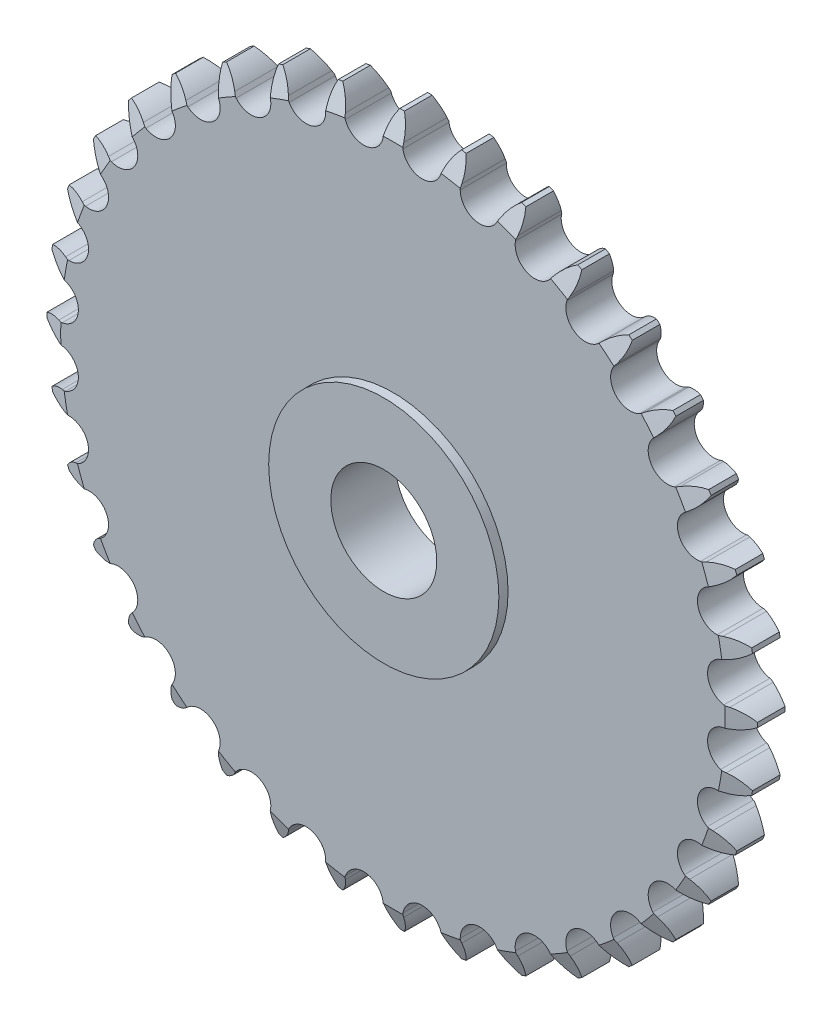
from build123d import *

# Parameters (mm, degrees)
SKETCH2_R                       = 68.60307911
BOSS_EXTRUDE1_DEPTH             = 5
BOSS_EXTRUDE2_REACH             = 99.148
BOSS_EXTRUDE2_DIRECTION_2_REACH = 99.148
CIRPATTERN1_COUNT               = 36
SKETCH6_R                       = 25
BOSS_EXTRUDE3_DEPTH             = 7
CUT_EXTRUDE1_DEPTH              = 110.349255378
CUT_EXTRUDE1_DEPTH_BACK         = 110.349255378
SKETCH7_R                       = 11.5


with BuildPart() as part:
    # Sketch2 → Boss-Extrude1 (new, symmetric)
    with BuildSketch(Plane.XY):
        Circle(SKETCH2_R)
    extrude(amount=BOSS_EXTRUDE1_DEPTH, both=True)

    # Boss-Extrude2: up to this face of the body (flat: up to its plane)
    boss_extrude2_end = Plane(part.part.faces().sort_by_distance((0, 0, 5))[0])
    # Sketch4 → Boss-Extrude2 (add, up to the picked face)
    with BuildSketch(Plane.XY, mode=Mode.PRIVATE) as boss_extrude2_sk1:
        with BuildLine():
            Line((-0.5, 77.163008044), (0.5, 77.163008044))
            ThreePointArc((0.5, 77.163008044), (1.520836, 75.099924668), (2.042896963, 72.85807911))
            Line((2.042896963, 72.85807911), (2.156832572, 71.85807911))
            ThreePointArc((2.156832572, 71.85807911), (3.469336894, 69.449250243), (5.979152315, 68.342023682))
            ThreePointArc((5.979152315, 68.342023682), (0, 68.60307911), (-5.979152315, 68.342023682))
            ThreePointArc((-5.979152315, 68.342023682), (-3.469336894, 69.449250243), (-2.156832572, 71.85807911))
            Line((-2.156832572, 71.85807911), (-2.042896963, 72.85807911))
            ThreePointArc((-2.042896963, 72.85807911), (-1.520836, 75.099924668), (-0.5, 77.163008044))
        make_face()
    boss_extrude2_tool1 = split(extrude(boss_extrude2_sk1.sketch, amount=BOSS_EXTRUDE2_REACH, mode=Mode.PRIVATE), bisect_by=boss_extrude2_end, keep=Keep.BOTH, mode=Mode.PRIVATE)
    boss_extrude2 = boss_extrude2_tool1.solids().sort_by(Axis((0, 71.819777, 0), (0, 0, 1)))[0]
    add(boss_extrude2)

    # Boss-Extrude2 direction 2: up to this face of the body (flat: up to its plane)
    boss_extrude2_direction_2_end = Plane(part.part.faces().sort_by_distance((0, 0, -5))[0])
    # Sketch4 → Boss-Extrude2 direction 2 (add, up to the picked face)
    with BuildSketch(Plane.XY, mode=Mode.PRIVATE) as boss_extrude2_direction_2_sk1:
        with BuildLine():
            Line((-0.5, 77.163008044), (0.5, 77.163008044))
            ThreePointArc((0.5, 77.163008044), (1.520836, 75.099924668), (2.042896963, 72.85807911))
            Line((2.042896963, 72.85807911), (2.156832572, 71.85807911))
            ThreePointArc((2.156832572, 71.85807911), (3.469336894, 69.449250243), (5.979152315, 68.342023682))
            ThreePointArc((5.979152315, 68.342023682), (0, 68.60307911), (-5.979152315, 68.342023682))
            ThreePointArc((-5.979152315, 68.342023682), (-3.469336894, 69.449250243), (-2.156832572, 71.85807911))
            Line((-2.156832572, 71.85807911), (-2.042896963, 72.85807911))
            ThreePointArc((-2.042896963, 72.85807911), (-1.520836, 75.099924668), (-0.5, 77.163008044))
        make_face()
    boss_extrude2_direction_2_tool1 = split(extrude(boss_extrude2_direction_2_sk1.sketch, amount=-BOSS_EXTRUDE2_DIRECTION_2_REACH, mode=Mode.PRIVATE), bisect_by=boss_extrude2_direction_2_end, keep=Keep.BOTH, mode=Mode.PRIVATE)
    boss_extrude2_direction_2 = boss_extrude2_direction_2_tool1.solids().sort_by(Axis((0, 71.819777, 0), (0, 0, -1)))[0]
    add(boss_extrude2_direction_2)

    # CirPattern1: Boss-Extrude2, Boss-Extrude2 direction 2 ×36 about axis
    cirpattern1_axis = Axis((0, 0, 0), (0, 0, 1))
    add([boss_extrude2.rotate(cirpattern1_axis, i * 360 / CIRPATTERN1_COUNT) for i in range(1, CIRPATTERN1_COUNT)])
    add([boss_extrude2_direction_2.rotate(cirpattern1_axis, i * 360 / CIRPATTERN1_COUNT) for i in range(1, CIRPATTERN1_COUNT)])

    # Sketch5 → Cut-Revolve7 (revolve, cut)
    with BuildSketch(Plane(origin=(0, 0, 0), x_dir=(0, 0, -1), z_dir=(1, 0, 0))):
        Polygon((0, 84.663008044), (-6, 84.663008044), (-6, 69.663008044), align=None)
        Polygon((6, 84.663008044), (0, 84.663008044), (6, 69.663008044), align=None)
    revolve(axis=Axis((0, 0, 0), (0, 0, 1)), mode=Mode.SUBTRACT)

    # Sketch6 → Boss-Extrude3 (add, symmetric)
    with BuildSketch(Plane.XY):
        Circle(SKETCH6_R)
    extrude(amount=BOSS_EXTRUDE3_DEPTH, both=True)

    # Sketch7 → Cut-Extrude1 (cut, two sides: drawn at the far end of the back side and taken through both)
    with BuildSketch(Plane.XY.offset(-CUT_EXTRUDE1_DEPTH_BACK)):
        Circle(SKETCH7_R)
    extrude(amount=CUT_EXTRUDE1_DEPTH + CUT_EXTRUDE1_DEPTH_BACK, mode=Mode.SUBTRACT)


solid = part.part
